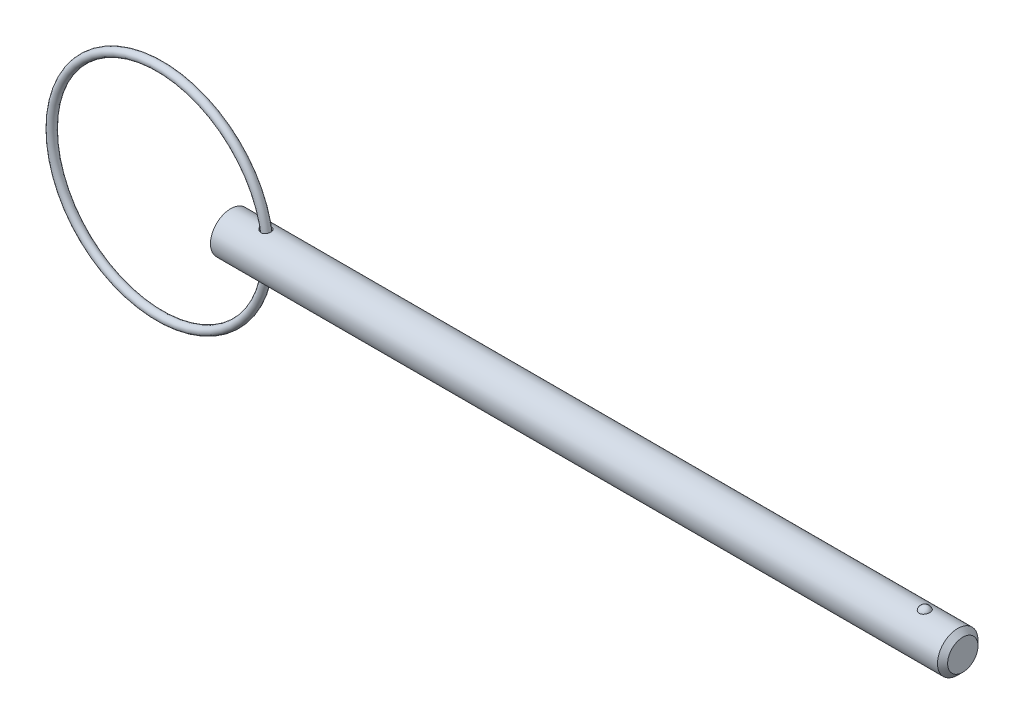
ISO-10303-21;
HEADER;
FILE_DESCRIPTION(('STEP AP214'),'2;1');
FILE_NAME('part.step','',(''),(''),'','','');
FILE_SCHEMA(('AUTOMOTIVE_DESIGN { 1 0 10303 214 1 1 1 1 }'));
ENDSEC;
DATA;
#1=APPLICATION_CONTEXT('core data for automotive mechanical design processes');
#2=APPLICATION_PROTOCOL_DEFINITION('international standard','automotive_design',2000,#1);
#3=PRODUCT_CONTEXT('',#1,'mechanical');
#4=PRODUCT('Part','Part','',(#3));
#5=PRODUCT_RELATED_PRODUCT_CATEGORY('part','',(#4));
#6=PRODUCT_DEFINITION_FORMATION('','',#4);
#7=PRODUCT_DEFINITION_CONTEXT('part definition',#1,'design');
#8=PRODUCT_DEFINITION('design','',#6,#7);
#9=PRODUCT_DEFINITION_SHAPE('','',#8);
#10=(LENGTH_UNIT() NAMED_UNIT(*) SI_UNIT(.MILLI.,.METRE.));
#11=(NAMED_UNIT(*) PLANE_ANGLE_UNIT() SI_UNIT($,.RADIAN.));
#12=(NAMED_UNIT(*) SI_UNIT($,.STERADIAN.) SOLID_ANGLE_UNIT());
#13=UNCERTAINTY_MEASURE_WITH_UNIT(LENGTH_MEASURE(1.E-05),#10,'distance_accuracy_value','');
#14=(GEOMETRIC_REPRESENTATION_CONTEXT(3) GLOBAL_UNCERTAINTY_ASSIGNED_CONTEXT((#13)) GLOBAL_UNIT_ASSIGNED_CONTEXT((#10,
#11,#12)) REPRESENTATION_CONTEXT('',''));
#15=CARTESIAN_POINT('',(0.,0.,0.));
#16=DIRECTION('',(0.,0.,1.));
#17=DIRECTION('',(1.,0.,0.));
#18=AXIS2_PLACEMENT_3D('',#15,#16,#17);
#19=CARTESIAN_POINT('',(-8.3302379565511,0.,0.));
#20=DIRECTION('',(0.,0.,1.));
#21=DIRECTION('',(1.,0.,0.));
#22=AXIS2_PLACEMENT_3D('',#19,#20,#21);
#23=TOROIDAL_SURFACE('',#22,12.7,0.476000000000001);
#24=CARTESIAN_POINT('',(4.8457620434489,0.,0.));
#25=VERTEX_POINT('',#24);
#26=VERTEX_LOOP('',#25);
#27=FACE_BOUND('',#26,.T.);
#28=ADVANCED_FACE('P0_F12',(#27),#23,.T.);
#29=CLOSED_SHELL('',(#28));
#30=MANIFOLD_SOLID_BREP('P0_B1',#29);
#31=CARTESIAN_POINT('',(0.,0.,0.));
#32=DIRECTION('',(1.,0.,0.));
#33=DIRECTION('',(0.,0.,-1.));
#34=AXIS2_PLACEMENT_3D('',#31,#32,#33);
#35=CYLINDRICAL_SURFACE('',#34,2.38);
#36=CARTESIAN_POINT('',(3.67748265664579,2.35074198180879,-0.372037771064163));
#37=CARTESIAN_POINT('',(3.70046616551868,2.34644965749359,-0.399158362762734));
#38=CARTESIAN_POINT('',(3.72581651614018,2.34199234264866,-0.424274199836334));
#39=CARTESIAN_POINT('',(3.78042747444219,2.33326580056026,-0.469907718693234));
#40=CARTESIAN_POINT('',(3.80969342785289,2.32899684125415,-0.490419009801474));
#41=CARTESIAN_POINT('',(3.87128330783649,2.32114904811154,-0.526312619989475));
#42=CARTESIAN_POINT('',(3.90360537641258,2.31756979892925,-0.541698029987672));
#43=CARTESIAN_POINT('',(3.9704452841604,2.31153734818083,-0.566889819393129));
#44=CARTESIAN_POINT('',(4.00496214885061,2.30908365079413,-0.576698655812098));
#45=CARTESIAN_POINT('',(4.07500735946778,2.30564492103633,-0.590297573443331));
#46=CARTESIAN_POINT('',(4.1105275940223,2.30465036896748,-0.594126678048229));
#47=CARTESIAN_POINT('',(4.18170718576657,2.30426876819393,-0.595606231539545));
#48=CARTESIAN_POINT('',(4.21736649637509,2.30488122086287,-0.593258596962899));
#49=CARTESIAN_POINT('',(4.28577822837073,2.30759475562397,-0.582609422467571));
#50=CARTESIAN_POINT('',(4.31858437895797,2.30961492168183,-0.574631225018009));
#51=CARTESIAN_POINT('',(4.38227060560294,2.31483318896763,-0.553233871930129));
#52=CARTESIAN_POINT('',(4.41315097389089,2.31803111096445,-0.539815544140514));
#53=CARTESIAN_POINT('',(4.47118254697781,2.3251225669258,-0.508384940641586));
#54=CARTESIAN_POINT('',(4.49841743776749,2.32899254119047,-0.490521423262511));
#55=CARTESIAN_POINT('',(4.5494826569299,2.33706025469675,-0.450515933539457));
#56=CARTESIAN_POINT('',(4.57331285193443,2.34125800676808,-0.42837379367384));
#57=CARTESIAN_POINT('',(4.6171621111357,2.34956202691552,-0.380209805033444));
#58=CARTESIAN_POINT('',(4.63714543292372,2.35366715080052,-0.354155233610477));
#59=CARTESIAN_POINT('',(4.67254725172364,2.36130301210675,-0.299034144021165));
#60=CARTESIAN_POINT('',(4.68796545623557,2.36483371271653,-0.26996743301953));
#61=CARTESIAN_POINT('',(4.71403776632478,2.37098548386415,-0.209215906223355));
#62=CARTESIAN_POINT('',(4.72462580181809,2.37359383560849,-0.177501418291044));
#63=CARTESIAN_POINT('',(4.74046966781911,2.37755210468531,-0.112692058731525));
#64=CARTESIAN_POINT('',(4.74572552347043,2.37890202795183,-0.0795971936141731));
#65=CARTESIAN_POINT('',(4.75077448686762,2.38019811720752,-0.0129544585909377));
#66=CARTESIAN_POINT('',(4.75056573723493,2.38014380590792,0.0205935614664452));
#67=CARTESIAN_POINT('',(4.74468604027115,2.37863606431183,0.0871753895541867));
#68=CARTESIAN_POINT('',(4.73901506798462,2.37718262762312,0.120209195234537));
#69=CARTESIAN_POINT('',(4.72236472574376,2.37303648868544,0.184779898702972));
#70=CARTESIAN_POINT('',(4.71139268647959,2.37034549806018,0.216318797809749));
#71=CARTESIAN_POINT('',(4.68441400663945,2.36401552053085,0.277063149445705));
#72=CARTESIAN_POINT('',(4.66840715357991,2.36037649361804,0.306268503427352));
#73=CARTESIAN_POINT('',(4.63170627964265,2.35253749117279,0.361595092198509));
#74=CARTESIAN_POINT('',(4.61100040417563,2.34833610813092,0.387708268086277));
#75=CARTESIAN_POINT('',(4.56544852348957,2.33984863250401,0.436017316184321));
#76=CARTESIAN_POINT('',(4.54060272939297,2.33556254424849,0.458213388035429));
#77=CARTESIAN_POINT('',(4.48760111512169,2.32742099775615,0.497916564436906));
#78=CARTESIAN_POINT('',(4.45946763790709,2.32356294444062,0.515452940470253));
#79=CARTESIAN_POINT('',(4.40055109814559,2.31668866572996,0.545520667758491));
#80=CARTESIAN_POINT('',(4.3697684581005,2.31367230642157,0.558052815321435));
#81=CARTESIAN_POINT('',(4.30694930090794,2.30886128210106,0.577633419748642));
#82=CARTESIAN_POINT('',(4.27493988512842,2.30704826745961,0.584764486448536));
#83=CARTESIAN_POINT('',(4.21014558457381,2.30475365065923,0.593744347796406));
#84=CARTESIAN_POINT('',(4.17736068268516,2.30427207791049,0.595593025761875));
#85=CARTESIAN_POINT('',(4.11170515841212,2.30466513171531,0.59406986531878));
#86=CARTESIAN_POINT('',(4.07883545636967,2.30554895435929,0.5906626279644));
#87=CARTESIAN_POINT('',(4.01408593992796,2.30856010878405,0.578780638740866));
#88=CARTESIAN_POINT('',(3.98220636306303,2.31068773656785,0.570304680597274));
#89=CARTESIAN_POINT('',(3.91877258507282,2.31605973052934,0.548090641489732));
#90=CARTESIAN_POINT('',(3.88730095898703,2.31935100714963,0.534128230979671));
#91=CARTESIAN_POINT('',(3.82705133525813,2.32664713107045,0.501391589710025));
#92=CARTESIAN_POINT('',(3.79827429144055,2.33065222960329,0.482615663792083));
#93=CARTESIAN_POINT('',(3.7429634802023,2.3391254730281,0.4397600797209));
#94=CARTESIAN_POINT('',(3.71658313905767,2.3436062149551,0.415484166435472));
#95=CARTESIAN_POINT('',(3.66839516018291,2.35235146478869,0.362706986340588));
#96=CARTESIAN_POINT('',(3.64658727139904,2.35661598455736,0.334205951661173));
#97=CARTESIAN_POINT('',(3.60882605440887,2.36432007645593,0.27436882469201));
#98=CARTESIAN_POINT('',(3.59274982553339,2.36777633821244,0.243112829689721));
#99=CARTESIAN_POINT('',(3.56652169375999,2.3735493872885,0.178112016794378));
#100=CARTESIAN_POINT('',(3.5563653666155,2.3758670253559,0.144369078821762));
#101=CARTESIAN_POINT('',(3.54309691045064,2.37891982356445,0.0783638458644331));
#102=CARTESIAN_POINT('',(3.53947205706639,2.37976992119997,0.0462095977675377));
#103=CARTESIAN_POINT('',(3.53785288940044,2.38014795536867,-0.0182487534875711));
#104=CARTESIAN_POINT('',(3.5398575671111,2.37967612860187,-0.0505528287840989));
#105=CARTESIAN_POINT('',(3.54913867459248,2.37752661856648,-0.112617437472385));
#106=CARTESIAN_POINT('',(3.5561353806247,2.37591295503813,-0.142422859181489));
#107=CARTESIAN_POINT('',(3.5747775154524,2.37172196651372,-0.200451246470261));
#108=CARTESIAN_POINT('',(3.58642049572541,2.36914514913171,-0.228675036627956));
#109=CARTESIAN_POINT('',(3.61071901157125,2.36396321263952,-0.276620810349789));
#110=CARTESIAN_POINT('',(3.62251818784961,2.36150235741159,-0.296799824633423));
#111=CARTESIAN_POINT('',(3.64836661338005,2.35629864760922,-0.335619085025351));
#112=CARTESIAN_POINT('',(3.66241608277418,2.353555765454,-0.354259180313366));
#113=CARTESIAN_POINT('',(3.67748265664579,2.35074198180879,-0.372037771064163));
#114=B_SPLINE_CURVE_WITH_KNOTS('',3,(#36,#37,#38,#39,#40,#41,#42,#43,#44,#45,#46,#47,#48,#49,
#50,#51,#52,#53,#54,#55,#56,#57,#58,#59,#60,#61,#62,#63,#64,#65,#66,#67,#68,#69,#70,#71,#72,#73,
#74,#75,#76,#77,#78,#79,#80,#81,#82,#83,#84,#85,#86,#87,#88,#89,#90,#91,#92,#93,#94,#95,#96,#97,
#98,#99,#100,#101,#102,#103,#104,#105,#106,#107,#108,#109,#110,#111,#112,#113),.UNSPECIFIED.,
.T.,.F.,(4,2,2,2,2,2,2,2,2,2,2,2,2,2,2,2,2,2,2,2,2,2,2,2,2,2,2,2,2,2,2,2,2,2,2,2,2,2,4),(0.,
0.107335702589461,0.214819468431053,0.322238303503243,0.429609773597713,0.536277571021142,
0.642912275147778,0.743874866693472,0.844822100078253,0.942762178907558,1.04070609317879,
1.13952022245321,1.23834068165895,1.33847507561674,1.43860899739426,1.53877695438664,
1.63894536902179,1.7389756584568,1.83901017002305,1.93929990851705,2.03958453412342,
2.13922343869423,2.23884648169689,2.33691317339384,2.43498203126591,2.53371427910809,
2.63247003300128,2.73577311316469,2.83911262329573,2.94697761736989,3.05483668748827,
3.16021984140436,3.2655241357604,3.36212700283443,3.45871257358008,3.55027266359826,
3.64178456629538,3.71214035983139,3.78250304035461),.UNSPECIFIED.);
#115=CARTESIAN_POINT('',(3.67748265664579,2.35074198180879,-0.372037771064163));
#116=VERTEX_POINT('',#115);
#117=EDGE_CURVE('P1_E40',#116,#116,#114,.T.);
#118=ORIENTED_EDGE('',*,*,#117,.T.);
#119=EDGE_LOOP('',(#118));
#120=FACE_BOUND('',#119,.T.);
#121=CARTESIAN_POINT('',(85.435,0.,0.));
#122=DIRECTION('',(1.,0.,0.));
#123=DIRECTION('',(0.,0.,-1.));
#124=AXIS2_PLACEMENT_3D('',#121,#122,#123);
#125=CIRCLE('',#124,2.38);
#126=CARTESIAN_POINT('',(85.435,0.,-2.38));
#127=VERTEX_POINT('',#126);
#128=EDGE_CURVE('P1_E25',#127,#127,#125,.T.);
#129=ORIENTED_EDGE('',*,*,#128,.F.);
#130=EDGE_LOOP('',(#129));
#131=FACE_BOUND('',#130,.T.);
#132=CARTESIAN_POINT('',(0.,0.,0.));
#133=DIRECTION('',(1.,0.,0.));
#134=DIRECTION('',(0.,0.,-1.));
#135=AXIS2_PLACEMENT_3D('',#132,#133,#134);
#136=CIRCLE('',#135,2.38);
#137=CARTESIAN_POINT('',(0.,0.,-2.38));
#138=VERTEX_POINT('',#137);
#139=EDGE_CURVE('P1_E9',#138,#138,#136,.T.);
#140=ORIENTED_EDGE('',*,*,#139,.T.);
#141=EDGE_LOOP('',(#140));
#142=FACE_BOUND('',#141,.T.);
#143=CARTESIAN_POINT('',(81.5634492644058,2.2921568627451,0.640637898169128));
#144=CARTESIAN_POINT('',(81.5303559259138,2.29215737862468,0.640637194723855));
#145=CARTESIAN_POINT('',(81.4972546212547,2.29293179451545,0.637884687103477));
#146=CARTESIAN_POINT('',(81.4320176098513,2.29594030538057,0.626968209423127));
#147=CARTESIAN_POINT('',(81.3998823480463,2.29817506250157,0.618801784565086));
#148=CARTESIAN_POINT('',(81.3375402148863,2.30384308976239,0.597351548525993));
#149=CARTESIAN_POINT('',(81.3073305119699,2.30727454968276,0.584075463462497));
#150=CARTESIAN_POINT('',(81.2495674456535,2.31495941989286,0.55282960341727));
#151=CARTESIAN_POINT('',(81.2220141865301,2.31921286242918,0.53485964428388));
#152=CARTESIAN_POINT('',(81.1695938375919,2.32820213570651,0.494282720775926));
#153=CARTESIAN_POINT('',(81.1448050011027,2.33294694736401,0.471576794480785));
#154=CARTESIAN_POINT('',(81.0992169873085,2.34234144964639,0.422446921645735));
#155=CARTESIAN_POINT('',(81.0784185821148,2.34699112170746,0.396022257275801));
#156=CARTESIAN_POINT('',(81.0403580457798,2.35593942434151,0.338855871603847));
#157=CARTESIAN_POINT('',(81.0233051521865,2.36021170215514,0.307970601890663));
#158=CARTESIAN_POINT('',(80.9943607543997,2.3677057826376,0.243750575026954));
#159=CARTESIAN_POINT('',(80.9824701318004,2.37092740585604,0.21041540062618));
#160=CARTESIAN_POINT('',(80.9638076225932,2.37606901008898,0.141189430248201));
#161=CARTESIAN_POINT('',(80.9571956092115,2.37794816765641,0.105252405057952));
#162=CARTESIAN_POINT('',(80.9498095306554,2.38005135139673,0.032735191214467));
#163=CARTESIAN_POINT('',(80.9490358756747,2.38027526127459,-0.00384504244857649));
#164=CARTESIAN_POINT('',(80.9533628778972,2.37903842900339,-0.0769838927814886));
#165=CARTESIAN_POINT('',(80.9585202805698,2.37756141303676,-0.113538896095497));
#166=CARTESIAN_POINT('',(80.9747013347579,2.37305303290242,-0.185229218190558));
#167=CARTESIAN_POINT('',(80.9857251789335,2.37002161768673,-0.220364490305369));
#168=CARTESIAN_POINT('',(81.0133977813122,2.36273722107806,-0.288156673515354));
#169=CARTESIAN_POINT('',(81.0300389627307,2.35848588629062,-0.320816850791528));
#170=CARTESIAN_POINT('',(81.0685984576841,2.34923130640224,-0.382744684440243));
#171=CARTESIAN_POINT('',(81.090516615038,2.34422808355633,-0.412012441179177));
#172=CARTESIAN_POINT('',(81.1387549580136,2.33412555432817,-0.465830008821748));
#173=CARTESIAN_POINT('',(81.1650028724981,2.32902887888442,-0.490444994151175));
#174=CARTESIAN_POINT('',(81.2214769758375,2.31926941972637,-0.534700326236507));
#175=CARTESIAN_POINT('',(81.251702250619,2.3146065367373,-0.554341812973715));
#176=CARTESIAN_POINT('',(81.3140618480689,2.30645675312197,-0.587312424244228));
#177=CARTESIAN_POINT('',(81.3460780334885,2.30293152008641,-0.600855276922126));
#178=CARTESIAN_POINT('',(81.4120795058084,2.29725171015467,-0.62222045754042));
#179=CARTESIAN_POINT('',(81.4460641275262,2.29509667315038,-0.63004470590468));
#180=CARTESIAN_POINT('',(81.513299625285,2.29249264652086,-0.639452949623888));
#181=CARTESIAN_POINT('',(81.5465087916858,2.29196755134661,-0.641315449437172));
#182=CARTESIAN_POINT('',(81.612763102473,2.29246849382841,-0.639522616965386));
#183=CARTESIAN_POINT('',(81.6458082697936,2.29349430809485,-0.63586807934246));
#184=CARTESIAN_POINT('',(81.7101025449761,2.29694059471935,-0.623301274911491));
#185=CARTESIAN_POINT('',(81.7413744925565,2.29933234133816,-0.61449721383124));
#186=CARTESIAN_POINT('',(81.8019952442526,2.30522511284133,-0.592006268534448));
#187=CARTESIAN_POINT('',(81.8313438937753,2.30872622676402,-0.57831899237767));
#188=CARTESIAN_POINT('',(81.8880369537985,2.31655795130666,-0.546112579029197));
#189=CARTESIAN_POINT('',(81.915320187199,2.32090569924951,-0.527490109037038));
#190=CARTESIAN_POINT('',(81.9664904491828,2.32992206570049,-0.48611785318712));
#191=CARTESIAN_POINT('',(81.9903767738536,2.33459075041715,-0.46336721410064));
#192=CARTESIAN_POINT('',(82.0352722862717,2.34399834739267,-0.413220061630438));
#193=CARTESIAN_POINT('',(82.0560972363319,2.34873051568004,-0.385657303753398));
#194=CARTESIAN_POINT('',(82.093056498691,2.35754932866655,-0.327455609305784));
#195=CARTESIAN_POINT('',(82.1091898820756,2.36163584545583,-0.296816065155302));
#196=CARTESIAN_POINT('',(82.1369822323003,2.36889321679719,-0.232047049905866));
#197=CARTESIAN_POINT('',(82.1484450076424,2.37202275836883,-0.197828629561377));
#198=CARTESIAN_POINT('',(82.1657523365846,2.37681926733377,-0.127900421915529));
#199=CARTESIAN_POINT('',(82.1715962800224,2.37848607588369,-0.0921904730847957));
#200=CARTESIAN_POINT('',(82.177605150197,2.38020024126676,-0.0196348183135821));
#201=CARTESIAN_POINT('',(82.1776704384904,2.38021918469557,0.01721985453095));
#202=CARTESIAN_POINT('',(82.1718689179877,2.37856356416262,0.0904219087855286));
#203=CARTESIAN_POINT('',(82.1660018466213,2.37688892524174,0.126769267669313));
#204=CARTESIAN_POINT('',(82.148425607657,2.37201688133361,0.198028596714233));
#205=CARTESIAN_POINT('',(82.136699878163,2.36881516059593,0.232936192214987));
#206=CARTESIAN_POINT('',(82.1076354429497,2.36123444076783,0.300196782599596));
#207=CARTESIAN_POINT('',(82.0902967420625,2.3568554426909,0.332549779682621));
#208=CARTESIAN_POINT('',(82.0505350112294,2.34744667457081,0.393495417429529));
#209=CARTESIAN_POINT('',(82.0281528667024,2.34242227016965,0.422115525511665));
#210=CARTESIAN_POINT('',(81.9787391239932,2.33227293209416,0.475004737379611));
#211=CARTESIAN_POINT('',(81.9517076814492,2.32714800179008,0.499273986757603));
#212=CARTESIAN_POINT('',(81.8944988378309,2.31755359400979,0.542046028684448));
#213=CARTESIAN_POINT('',(81.8644297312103,2.31306986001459,0.560690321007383));
#214=CARTESIAN_POINT('',(81.8013869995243,2.3051412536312,0.592447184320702));
#215=CARTESIAN_POINT('',(81.7684158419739,2.30169550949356,0.605564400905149));
#216=CARTESIAN_POINT('',(81.7068424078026,2.29677744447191,0.623927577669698));
#217=CARTESIAN_POINT('',(81.6785555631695,2.29505839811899,0.630178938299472));
#218=CARTESIAN_POINT('',(81.6213308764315,2.29274795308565,0.638534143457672));
#219=CARTESIAN_POINT('',(81.5923931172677,2.29215641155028,0.64063851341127));
#220=CARTESIAN_POINT('',(81.5634492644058,2.2921568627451,0.640637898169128));
#221=B_SPLINE_CURVE_WITH_KNOTS('',3,(#143,#144,#145,#146,#147,#148,#149,#150,#151,#152,#153,
#154,#155,#156,#157,#158,#159,#160,#161,#162,#163,#164,#165,#166,#167,#168,#169,#170,#171,#172,
#173,#174,#175,#176,#177,#178,#179,#180,#181,#182,#183,#184,#185,#186,#187,#188,#189,#190,#191,
#192,#193,#194,#195,#196,#197,#198,#199,#200,#201,#202,#203,#204,#205,#206,#207,#208,#209,#210,
#211,#212,#213,#214,#215,#216,#217,#218,#219,#220),.UNSPECIFIED.,.T.,.F.,(4,2,2,2,2,2,2,2,2,2,2,
2,2,2,2,2,2,2,2,2,2,2,2,2,2,2,2,2,2,2,2,2,2,2,2,2,2,2,4),(0.,0.0991724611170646,
0.198389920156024,0.297457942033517,0.396529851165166,0.497927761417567,0.599345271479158,
0.705475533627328,0.811623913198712,0.92087671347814,1.03013718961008,1.1404517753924,
1.25076998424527,1.3609399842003,1.47110672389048,1.57959248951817,1.68805336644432,
1.79234266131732,1.89659691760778,1.99590391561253,2.0951966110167,2.19247425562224,
2.28975970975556,2.38926978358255,2.48880044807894,2.5929358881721,2.69709193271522,
2.80525821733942,2.91343624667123,3.02347917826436,3.13352698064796,3.24388765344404,
3.35424823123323,3.46374443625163,3.57323697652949,3.67968690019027,3.78604717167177,
3.87279565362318,3.95953314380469),.UNSPECIFIED.);
#222=CARTESIAN_POINT('',(81.5634492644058,2.2921568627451,0.640637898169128));
#223=VERTEX_POINT('',#222);
#224=EDGE_CURVE('P1_E34',#223,#223,#221,.T.);
#225=ORIENTED_EDGE('',*,*,#224,.T.);
#226=EDGE_LOOP('',(#225));
#227=FACE_BOUND('',#226,.T.);
#228=CARTESIAN_POINT('',(3.67748265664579,-2.35074198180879,-0.372037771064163));
#229=CARTESIAN_POINT('',(3.65652023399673,-2.35465684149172,-0.34730037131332));
#230=CARTESIAN_POINT('',(3.63751328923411,-2.35843676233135,-0.320880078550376));
#231=CARTESIAN_POINT('',(3.60404107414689,-2.36534227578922,-0.265218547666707));
#232=CARTESIAN_POINT('',(3.58957485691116,-2.36846800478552,-0.235977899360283));
#233=CARTESIAN_POINT('',(3.56572865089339,-2.37373250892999,-0.17528149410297));
#234=CARTESIAN_POINT('',(3.55636565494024,-2.37586798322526,-0.143818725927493));
#235=CARTESIAN_POINT('',(3.54325775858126,-2.37888184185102,-0.0796854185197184));
#236=CARTESIAN_POINT('',(3.53951093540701,-2.37976065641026,-0.047015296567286));
#237=CARTESIAN_POINT('',(3.53787230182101,-2.38014359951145,0.0167788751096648));
#238=CARTESIAN_POINT('',(3.53968714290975,-2.37971660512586,0.0478953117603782));
#239=CARTESIAN_POINT('',(3.54844977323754,-2.37768530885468,0.10935299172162));
#240=CARTESIAN_POINT('',(3.55539746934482,-2.37608102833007,0.139694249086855));
#241=CARTESIAN_POINT('',(3.57400783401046,-2.37189301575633,0.198451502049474));
#242=CARTESIAN_POINT('',(3.58561918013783,-2.36931996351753,0.226884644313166));
#243=CARTESIAN_POINT('',(3.61310377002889,-2.36345094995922,0.281524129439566));
#244=CARTESIAN_POINT('',(3.62897804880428,-2.36015481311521,0.307729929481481));
#245=CARTESIAN_POINT('',(3.66562367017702,-2.35291979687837,0.359001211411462));
#246=CARTESIAN_POINT('',(3.68664499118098,-2.34895316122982,0.38388386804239));
#247=CARTESIAN_POINT('',(3.73230875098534,-2.34094029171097,0.430056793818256));
#248=CARTESIAN_POINT('',(3.75695270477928,-2.33689402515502,0.451345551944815));
#249=CARTESIAN_POINT('',(3.81128123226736,-2.32880869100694,0.491427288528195));
#250=CARTESIAN_POINT('',(3.84120889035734,-2.32479472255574,0.509896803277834));
#251=CARTESIAN_POINT('',(3.90376464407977,-2.31758417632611,0.541729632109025));
#252=CARTESIAN_POINT('',(3.93639323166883,-2.31438774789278,0.555092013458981));
#253=CARTESIAN_POINT('',(4.00416670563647,-2.30915137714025,0.576493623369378));
#254=CARTESIAN_POINT('',(4.0393485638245,-2.30713552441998,0.584422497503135));
#255=CARTESIAN_POINT('',(4.11060438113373,-2.30465258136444,0.594140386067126));
#256=CARTESIAN_POINT('',(4.14667802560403,-2.30418495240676,0.595931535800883));
#257=CARTESIAN_POINT('',(4.21693481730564,-2.30488473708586,0.593218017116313));
#258=CARTESIAN_POINT('',(4.25112951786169,-2.30597897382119,0.588995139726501));
#259=CARTESIAN_POINT('',(4.31821509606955,-2.30956729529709,0.57476284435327));
#260=CARTESIAN_POINT('',(4.35110629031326,-2.31206103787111,0.564754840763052));
#261=CARTESIAN_POINT('',(4.41316900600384,-2.31802118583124,0.53975368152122));
#262=CARTESIAN_POINT('',(4.44243993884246,-2.32144077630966,0.524995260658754));
#263=CARTESIAN_POINT('',(4.49802365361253,-2.32890801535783,0.49080792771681));
#264=CARTESIAN_POINT('',(4.52433643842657,-2.33295566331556,0.471379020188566));
#265=CARTESIAN_POINT('',(4.57327790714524,-2.3412242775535,0.428422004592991));
#266=CARTESIAN_POINT('',(4.59591094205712,-2.34544503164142,0.404898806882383));
#267=CARTESIAN_POINT('',(4.63697038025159,-2.35360640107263,0.354387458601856));
#268=CARTESIAN_POINT('',(4.65539647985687,-2.35754699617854,0.327399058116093));
#269=CARTESIAN_POINT('',(4.68784943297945,-2.36478461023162,0.270249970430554));
#270=CARTESIAN_POINT('',(4.70180333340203,-2.36807065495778,0.240046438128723));
#271=CARTESIAN_POINT('',(4.72457181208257,-2.3735656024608,0.177668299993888));
#272=CARTESIAN_POINT('',(4.73338630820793,-2.37577448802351,0.145493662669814));
#273=CARTESIAN_POINT('',(4.74568442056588,-2.37888446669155,0.0799353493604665));
#274=CARTESIAN_POINT('',(4.74914498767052,-2.37977990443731,0.0465470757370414));
#275=CARTESIAN_POINT('',(4.7505750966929,-2.38014803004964,-0.0203543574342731));
#276=CARTESIAN_POINT('',(4.74854468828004,-2.37962073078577,-0.0538675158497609));
#277=CARTESIAN_POINT('',(4.73905606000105,-2.37720346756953,-0.119981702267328));
#278=CARTESIAN_POINT('',(4.73161109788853,-2.37531683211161,-0.152584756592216));
#279=CARTESIAN_POINT('',(4.71149336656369,-2.37038779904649,-0.21604453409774));
#280=CARTESIAN_POINT('',(4.69882040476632,-2.36734535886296,-0.246901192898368));
#281=CARTESIAN_POINT('',(4.66852750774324,-2.3604270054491,-0.306062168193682));
#282=CARTESIAN_POINT('',(4.6508974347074,-2.35654938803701,-0.334361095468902));
#283=CARTESIAN_POINT('',(4.61113860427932,-2.34839114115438,-0.387535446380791));
#284=CARTESIAN_POINT('',(4.5890098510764,-2.34411051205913,-0.412410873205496));
#285=CARTESIAN_POINT('',(4.54086484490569,-2.33563475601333,-0.457982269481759));
#286=CARTESIAN_POINT('',(4.51485596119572,-2.33143948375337,-0.478685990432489));
#287=CARTESIAN_POINT('',(4.45962330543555,-2.32360655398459,-0.515369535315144));
#288=CARTESIAN_POINT('',(4.43040000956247,-2.31996881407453,-0.53135005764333));
#289=CARTESIAN_POINT('',(4.37002624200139,-2.31371771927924,-0.557938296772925));
#290=CARTESIAN_POINT('',(4.33891082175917,-2.31108995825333,-0.56862225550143));
#291=CARTESIAN_POINT('',(4.27527207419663,-2.30707117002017,-0.584715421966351));
#292=CARTESIAN_POINT('',(4.24274884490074,-2.30568005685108,-0.590124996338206));
#293=CARTESIAN_POINT('',(4.17738918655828,-2.30427145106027,-0.595601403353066));
#294=CARTESIAN_POINT('',(4.14455499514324,-2.3042474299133,-0.595693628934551));
#295=CARTESIAN_POINT('',(4.07930726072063,-2.30552664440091,-0.590722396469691));
#296=CARTESIAN_POINT('',(4.04689380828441,-2.3068301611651,-0.585657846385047));
#297=CARTESIAN_POINT('',(3.98220150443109,-2.31066076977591,-0.570360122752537));
#298=CARTESIAN_POINT('',(3.94996602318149,-2.31322859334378,-0.559954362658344));
#299=CARTESIAN_POINT('',(3.88760707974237,-2.31930140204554,-0.534242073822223));
#300=CARTESIAN_POINT('',(3.85748403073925,-2.32280656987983,-0.518934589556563));
#301=CARTESIAN_POINT('',(3.80033132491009,-2.33034138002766,-0.483968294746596));
#302=CARTESIAN_POINT('',(3.77327623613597,-2.33436601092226,-0.464349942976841));
#303=CARTESIAN_POINT('',(3.72262060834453,-2.34255524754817,-0.421092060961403));
#304=CARTESIAN_POINT('',(3.69901956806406,-2.34671983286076,-0.397453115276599));
#305=CARTESIAN_POINT('',(3.67748265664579,-2.35074198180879,-0.372037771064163));
#306=B_SPLINE_CURVE_WITH_KNOTS('',3,(#228,#229,#230,#231,#232,#233,#234,#235,#236,#237,#238,
#239,#240,#241,#242,#243,#244,#245,#246,#247,#248,#249,#250,#251,#252,#253,#254,#255,#256,#257,
#258,#259,#260,#261,#262,#263,#264,#265,#266,#267,#268,#269,#270,#271,#272,#273,#274,#275,#276,
#277,#278,#279,#280,#281,#282,#283,#284,#285,#286,#287,#288,#289,#290,#291,#292,#293,#294,#295,
#296,#297,#298,#299,#300,#301,#302,#303,#304,#305),.UNSPECIFIED.,.T.,.F.,(4,2,2,2,2,2,2,2,2,2,2,
2,2,2,2,2,2,2,2,2,2,2,2,2,2,2,2,2,2,2,2,2,2,2,2,2,2,2,4),(0.,0.09787553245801,0.19573064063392,
0.293909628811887,0.39205499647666,0.485114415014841,0.578172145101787,0.670232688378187,
0.762315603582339,0.860342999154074,0.958411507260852,1.06411708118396,1.16984195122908,
1.27765506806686,1.38543067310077,1.48831936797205,1.59118291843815,1.68959047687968,
1.78799793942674,1.88628818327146,1.98458551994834,2.08441314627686,2.18424236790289,
2.28450017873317,2.3847570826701,2.4847693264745,2.58478525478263,2.68500723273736,
2.78522911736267,2.8852630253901,2.98528213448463,3.08381637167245,3.18234375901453,
3.28040059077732,3.37847819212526,3.47994551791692,3.58143263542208,3.68200512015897,
3.78256299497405),.UNSPECIFIED.);
#307=CARTESIAN_POINT('',(3.67748265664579,-2.35074198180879,-0.372037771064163));
#308=VERTEX_POINT('',#307);
#309=EDGE_CURVE('P1_E17',#308,#308,#306,.T.);
#310=ORIENTED_EDGE('',*,*,#309,.T.);
#311=EDGE_LOOP('',(#310));
#312=FACE_BOUND('',#311,.T.);
#313=ADVANCED_FACE('P1_F13',(#120,#131,#142,#227,#312),#35,.T.);
#314=CARTESIAN_POINT('',(0.,0.,0.));
#315=DIRECTION('',(-1.,0.,0.));
#316=DIRECTION('',(0.,0.,1.));
#317=AXIS2_PLACEMENT_3D('',#314,#315,#316);
#318=PLANE('',#317);
#319=ORIENTED_EDGE('',*,*,#139,.F.);
#320=EDGE_LOOP('',(#319));
#321=FACE_BOUND('',#320,.T.);
#322=ADVANCED_FACE('P1_F15',(#321),#318,.T.);
#323=CARTESIAN_POINT('',(86.03,0.,0.));
#324=DIRECTION('',(-1.,0.,0.));
#325=DIRECTION('',(0.,0.,1.));
#326=AXIS2_PLACEMENT_3D('',#323,#324,#325);
#327=CONICAL_SURFACE('',#326,1.78500000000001,0.785398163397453);
#328=ORIENTED_EDGE('',*,*,#128,.T.);
#329=EDGE_LOOP('',(#328));
#330=FACE_BOUND('',#329,.T.);
#331=CARTESIAN_POINT('',(86.03,0.,0.));
#332=DIRECTION('',(1.,0.,0.));
#333=DIRECTION('',(0.,0.,-1.));
#334=AXIS2_PLACEMENT_3D('',#331,#332,#333);
#335=CIRCLE('',#334,1.78500000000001);
#336=CARTESIAN_POINT('',(86.03,0.,-1.78500000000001));
#337=VERTEX_POINT('',#336);
#338=EDGE_CURVE('P1_E30',#337,#337,#335,.T.);
#339=ORIENTED_EDGE('',*,*,#338,.F.);
#340=EDGE_LOOP('',(#339));
#341=FACE_BOUND('',#340,.T.);
#342=ADVANCED_FACE('P1_F55',(#330,#341),#327,.T.);
#343=CARTESIAN_POINT('',(86.03,1.78500000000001,0.));
#344=DIRECTION('',(1.,0.,0.));
#345=DIRECTION('',(0.,0.,-1.));
#346=AXIS2_PLACEMENT_3D('',#343,#344,#345);
#347=PLANE('',#346);
#348=ORIENTED_EDGE('',*,*,#338,.T.);
#349=EDGE_LOOP('',(#348));
#350=FACE_BOUND('',#349,.T.);
#351=ADVANCED_FACE('P1_F51',(#350),#347,.T.);
#352=CARTESIAN_POINT('',(81.5634492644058,2.142,0.));
#353=DIRECTION('',(-1.,0.,0.));
#354=DIRECTION('',(0.,1.,0.));
#355=AXIS2_PLACEMENT_3D('',#352,#353,#354);
#356=SPHERICAL_SURFACE('',#355,0.658000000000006);
#357=ORIENTED_EDGE('',*,*,#224,.F.);
#358=EDGE_LOOP('',(#357));
#359=FACE_BOUND('',#358,.T.);
#360=ADVANCED_FACE('P1_F46',(#359),#356,.T.);
#361=CARTESIAN_POINT('',(-8.33023795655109,0.,0.));
#362=DIRECTION('',(0.,0.,1.));
#363=DIRECTION('',(1.,0.,0.));
#364=AXIS2_PLACEMENT_3D('',#361,#362,#363);
#365=TOROIDAL_SURFACE('',#364,12.7,0.594999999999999);
#366=ORIENTED_EDGE('',*,*,#309,.F.);
#367=EDGE_LOOP('',(#366));
#368=FACE_BOUND('',#367,.T.);
#369=ORIENTED_EDGE('',*,*,#117,.F.);
#370=EDGE_LOOP('',(#369));
#371=FACE_BOUND('',#370,.T.);
#372=ADVANCED_FACE('P1_F50',(#368,#371),#365,.F.);
#373=CLOSED_SHELL('',(#313,#322,#342,#351,#360,#372));
#374=MANIFOLD_SOLID_BREP('P1_B1',#373);
#375=ADVANCED_BREP_SHAPE_REPRESENTATION('',(#18,#30,#374),#14);
#376=SHAPE_DEFINITION_REPRESENTATION(#9,#375);
ENDSEC;
END-ISO-10303-21;
